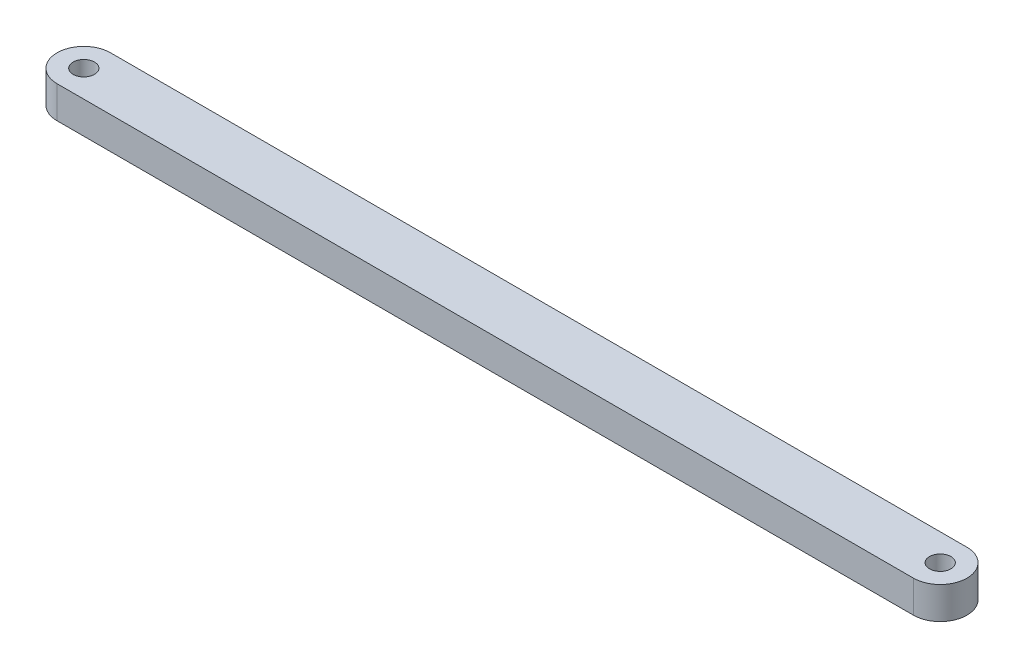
from build123d import *

# Parameters (mm, degrees)
SKETCH1_R           = 10
BOSS_EXTRUDE1_DEPTH = 30


with BuildPart() as part:
    # Sketch1 → Boss-Extrude1 (new body)
    with BuildSketch(Plane(origin=(0, 0, 0), x_dir=(1, 0, 0), z_dir=(0, 1, 0))):
        with BuildLine():
            Line((-400, 25), (400, 25))
            ThreePointArc((400, 25), (425, 0), (400, -25))
            Line((400, -25), (-400, -25))
            ThreePointArc((-400, -25), (-425, 0), (-400, 25))
        make_face()
        with Locations(Location((-400, 0, 0), (0, 0, 270))):
            Circle(SKETCH1_R, mode=Mode.SUBTRACT)
        with Locations(Location((400, 0, 0), (0, 0, 270))):
            Circle(SKETCH1_R, mode=Mode.SUBTRACT)
    extrude(amount=BOSS_EXTRUDE1_DEPTH)


solid = part.part
